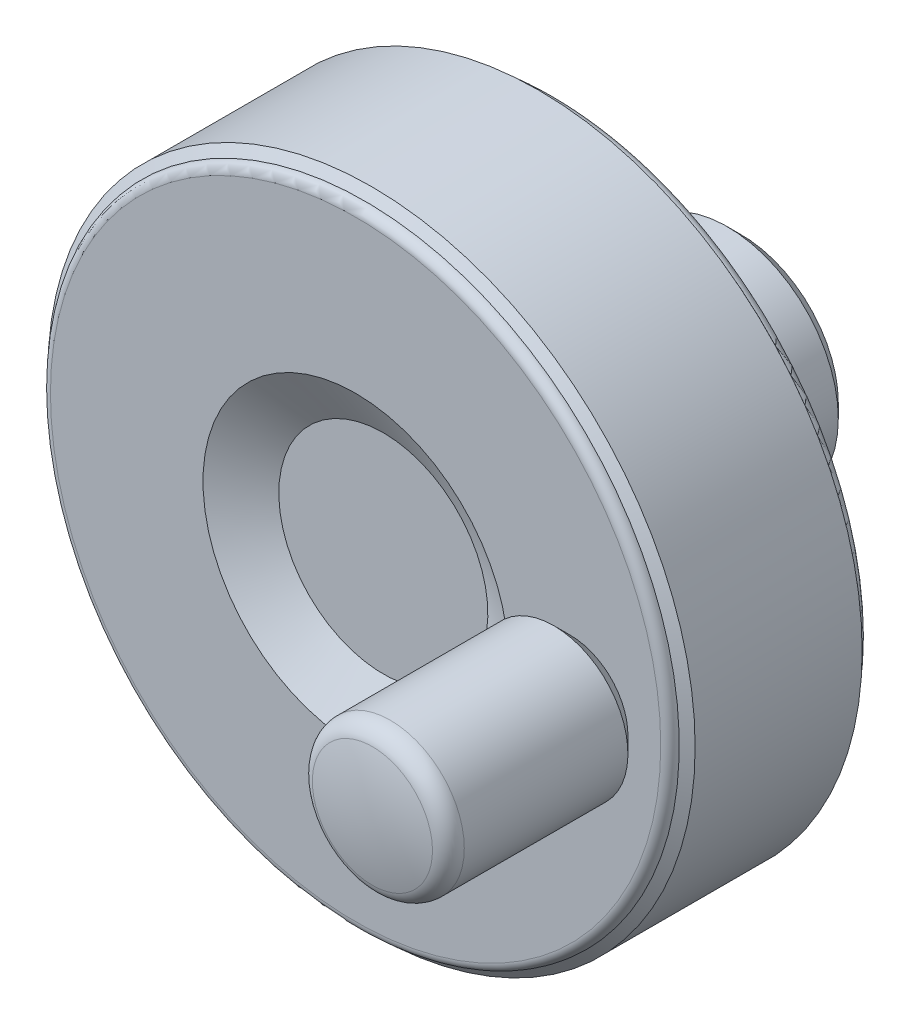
ISO-10303-21;
HEADER;
FILE_DESCRIPTION(('STEP AP214'),'2;1');
FILE_NAME('part.step','',(''),(''),'','','');
FILE_SCHEMA(('AUTOMOTIVE_DESIGN { 1 0 10303 214 1 1 1 1 }'));
ENDSEC;
DATA;
#1=APPLICATION_CONTEXT('core data for automotive mechanical design processes');
#2=APPLICATION_PROTOCOL_DEFINITION('international standard','automotive_design',2000,#1);
#3=PRODUCT_CONTEXT('',#1,'mechanical');
#4=PRODUCT('Part','Part','',(#3));
#5=PRODUCT_RELATED_PRODUCT_CATEGORY('part','',(#4));
#6=PRODUCT_DEFINITION_FORMATION('','',#4);
#7=PRODUCT_DEFINITION_CONTEXT('part definition',#1,'design');
#8=PRODUCT_DEFINITION('design','',#6,#7);
#9=PRODUCT_DEFINITION_SHAPE('','',#8);
#10=(LENGTH_UNIT() NAMED_UNIT(*) SI_UNIT(.MILLI.,.METRE.));
#11=(NAMED_UNIT(*) PLANE_ANGLE_UNIT() SI_UNIT($,.RADIAN.));
#12=(NAMED_UNIT(*) SI_UNIT($,.STERADIAN.) SOLID_ANGLE_UNIT());
#13=UNCERTAINTY_MEASURE_WITH_UNIT(LENGTH_MEASURE(1.E-05),#10,'distance_accuracy_value','');
#14=(GEOMETRIC_REPRESENTATION_CONTEXT(3) GLOBAL_UNCERTAINTY_ASSIGNED_CONTEXT((#13)) GLOBAL_UNIT_ASSIGNED_CONTEXT((#10,
#11,#12)) REPRESENTATION_CONTEXT('',''));
#15=CARTESIAN_POINT('',(0.,0.,0.));
#16=DIRECTION('',(0.,0.,1.));
#17=DIRECTION('',(1.,0.,0.));
#18=AXIS2_PLACEMENT_3D('',#15,#16,#17);
#19=CARTESIAN_POINT('',(-9.66666666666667,0.,4.55662432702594));
#20=DIRECTION('',(0.,-0.5,-0.866025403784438));
#21=DIRECTION('',(0.,-0.866025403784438,0.5));
#22=AXIS2_PLACEMENT_3D('',#19,#20,#21);
#23=PLANE('',#22);
#24=DIRECTION('',(1.,0.,0.));
#25=VECTOR('',#24,1.);
#26=CARTESIAN_POINT('',(-9.66666666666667,-1.25,5.27831216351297));
#27=LINE('',#26,#25);
#28=CARTESIAN_POINT('',(-12.,-1.25,5.27831216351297));
#29=VERTEX_POINT('',#28);
#30=CARTESIAN_POINT('',(-9.66666666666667,-1.25,5.27831216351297));
#31=VERTEX_POINT('',#30);
#32=EDGE_CURVE('E84',#29,#31,#27,.T.);
#33=ORIENTED_EDGE('',*,*,#32,.T.);
#34=DIRECTION('',(0.,-0.866025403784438,0.5));
#35=VECTOR('',#34,1.);
#36=CARTESIAN_POINT('',(-9.66666666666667,0.,4.55662432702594));
#37=LINE('',#36,#35);
#38=CARTESIAN_POINT('',(-9.66666666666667,0.,4.55662432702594));
#39=VERTEX_POINT('',#38);
#40=EDGE_CURVE('E72',#39,#31,#37,.T.);
#41=ORIENTED_EDGE('',*,*,#40,.F.);
#42=DIRECTION('',(-1.,0.,0.));
#43=VECTOR('',#42,1.);
#44=CARTESIAN_POINT('',(-9.66666666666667,0.,4.55662432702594));
#45=LINE('',#44,#43);
#46=CARTESIAN_POINT('',(-12.,0.,4.55662432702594));
#47=VERTEX_POINT('',#46);
#48=EDGE_CURVE('E290',#39,#47,#45,.T.);
#49=ORIENTED_EDGE('',*,*,#48,.T.);
#50=DIRECTION('',(0.,-0.866025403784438,0.5));
#51=VECTOR('',#50,1.);
#52=CARTESIAN_POINT('',(-12.,0.,4.55662432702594));
#53=LINE('',#52,#51);
#54=EDGE_CURVE('E67',#29,#47,#53,.F.);
#55=ORIENTED_EDGE('',*,*,#54,.F.);
#56=EDGE_LOOP('',(#33,#41,#49,#55));
#57=FACE_BOUND('',#56,.T.);
#58=ADVANCED_FACE('F14',(#57),#23,.F.);
#59=CARTESIAN_POINT('',(-9.66666666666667,-1.25,5.27831216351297));
#60=DIRECTION('',(0.,-1.,0.));
#61=DIRECTION('',(1.,0.,0.));
#62=AXIS2_PLACEMENT_3D('',#59,#60,#61);
#63=PLANE('',#62);
#64=DIRECTION('',(-1.,0.,0.));
#65=VECTOR('',#64,1.);
#66=CARTESIAN_POINT('',(-9.66666666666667,-1.25,6.72168783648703));
#67=LINE('',#66,#65);
#68=CARTESIAN_POINT('',(-12.,-1.25,6.72168783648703));
#69=VERTEX_POINT('',#68);
#70=CARTESIAN_POINT('',(-9.66666666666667,-1.25,6.72168783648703));
#71=VERTEX_POINT('',#70);
#72=EDGE_CURVE('E86',#69,#71,#67,.F.);
#73=ORIENTED_EDGE('',*,*,#72,.T.);
#74=DIRECTION('',(0.,0.,1.));
#75=VECTOR('',#74,1.);
#76=CARTESIAN_POINT('',(-9.66666666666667,-1.25,5.27831216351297));
#77=LINE('',#76,#75);
#78=EDGE_CURVE('E75',#31,#71,#77,.T.);
#79=ORIENTED_EDGE('',*,*,#78,.F.);
#80=ORIENTED_EDGE('',*,*,#32,.F.);
#81=DIRECTION('',(0.,0.,1.));
#82=VECTOR('',#81,1.);
#83=CARTESIAN_POINT('',(-12.,-1.25,5.27831216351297));
#84=LINE('',#83,#82);
#85=EDGE_CURVE('E88',#69,#29,#84,.F.);
#86=ORIENTED_EDGE('',*,*,#85,.F.);
#87=EDGE_LOOP('',(#73,#79,#80,#86));
#88=FACE_BOUND('',#87,.T.);
#89=ADVANCED_FACE('F83',(#88),#63,.F.);
#90=CARTESIAN_POINT('',(-9.66666666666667,1.25,5.27831216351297));
#91=DIRECTION('',(0.,0.5,-0.866025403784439));
#92=DIRECTION('',(0.,-0.866025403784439,-0.5));
#93=AXIS2_PLACEMENT_3D('',#90,#91,#92);
#94=PLANE('',#93);
#95=ORIENTED_EDGE('',*,*,#48,.F.);
#96=DIRECTION('',(0.,-0.86602540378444,-0.5));
#97=VECTOR('',#96,1.);
#98=CARTESIAN_POINT('',(-9.66666666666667,1.25,5.27831216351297));
#99=LINE('',#98,#97);
#100=CARTESIAN_POINT('',(-9.66666666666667,1.25,5.27831216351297));
#101=VERTEX_POINT('',#100);
#102=EDGE_CURVE('E78',#101,#39,#99,.T.);
#103=ORIENTED_EDGE('',*,*,#102,.F.);
#104=DIRECTION('',(-1.,0.,0.));
#105=VECTOR('',#104,1.);
#106=CARTESIAN_POINT('',(-9.66666666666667,1.25,5.27831216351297));
#107=LINE('',#106,#105);
#108=CARTESIAN_POINT('',(-12.,1.25,5.27831216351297));
#109=VERTEX_POINT('',#108);
#110=EDGE_CURVE('E278',#101,#109,#107,.T.);
#111=ORIENTED_EDGE('',*,*,#110,.T.);
#112=DIRECTION('',(0.,-0.866025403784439,-0.5));
#113=VECTOR('',#112,1.);
#114=CARTESIAN_POINT('',(-12.,1.25,5.27831216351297));
#115=LINE('',#114,#113);
#116=EDGE_CURVE('E288',#47,#109,#115,.F.);
#117=ORIENTED_EDGE('',*,*,#116,.F.);
#118=EDGE_LOOP('',(#95,#103,#111,#117));
#119=FACE_BOUND('',#118,.T.);
#120=ADVANCED_FACE('F305',(#119),#94,.F.);
#121=CARTESIAN_POINT('',(-9.66666666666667,-1.25,6.72168783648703));
#122=DIRECTION('',(0.,-0.5,0.866025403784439));
#123=DIRECTION('',(0.,0.866025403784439,0.5));
#124=AXIS2_PLACEMENT_3D('',#121,#122,#123);
#125=PLANE('',#124);
#126=DIRECTION('',(-1.,0.,0.));
#127=VECTOR('',#126,1.);
#128=CARTESIAN_POINT('',(-9.66666666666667,0.,7.44337567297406));
#129=LINE('',#128,#127);
#130=CARTESIAN_POINT('',(-12.,0.,7.44337567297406));
#131=VERTEX_POINT('',#130);
#132=CARTESIAN_POINT('',(-9.66666666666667,0.,7.44337567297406));
#133=VERTEX_POINT('',#132);
#134=EDGE_CURVE('E274',#131,#133,#129,.F.);
#135=ORIENTED_EDGE('',*,*,#134,.T.);
#136=DIRECTION('',(0.,0.86602540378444,0.5));
#137=VECTOR('',#136,1.);
#138=CARTESIAN_POINT('',(-9.66666666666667,-1.25,6.72168783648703));
#139=LINE('',#138,#137);
#140=EDGE_CURVE('E283',#71,#133,#139,.T.);
#141=ORIENTED_EDGE('',*,*,#140,.F.);
#142=ORIENTED_EDGE('',*,*,#72,.F.);
#143=DIRECTION('',(0.,0.866025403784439,0.5));
#144=VECTOR('',#143,1.);
#145=CARTESIAN_POINT('',(-12.,-1.25,6.72168783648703));
#146=LINE('',#145,#144);
#147=EDGE_CURVE('E34',#131,#69,#146,.F.);
#148=ORIENTED_EDGE('',*,*,#147,.F.);
#149=EDGE_LOOP('',(#135,#141,#142,#148));
#150=FACE_BOUND('',#149,.T.);
#151=ADVANCED_FACE('F295',(#150),#125,.F.);
#152=CARTESIAN_POINT('',(-9.66666666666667,0.,0.));
#153=DIRECTION('',(-1.,0.,0.));
#154=DIRECTION('',(0.,-1.,0.));
#155=AXIS2_PLACEMENT_3D('',#152,#153,#154);
#156=PLANE('',#155);
#157=ORIENTED_EDGE('',*,*,#78,.T.);
#158=ORIENTED_EDGE('',*,*,#140,.T.);
#159=DIRECTION('',(0.,0.866025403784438,-0.5));
#160=VECTOR('',#159,1.);
#161=CARTESIAN_POINT('',(-9.66666666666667,0.,7.44337567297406));
#162=LINE('',#161,#160);
#163=CARTESIAN_POINT('',(-9.66666666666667,1.25,6.72168783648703));
#164=VERTEX_POINT('',#163);
#165=EDGE_CURVE('E271',#133,#164,#162,.T.);
#166=ORIENTED_EDGE('',*,*,#165,.T.);
#167=DIRECTION('',(0.,0.,1.));
#168=VECTOR('',#167,1.);
#169=CARTESIAN_POINT('',(-9.66666666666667,1.25,6.72168783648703));
#170=LINE('',#169,#168);
#171=EDGE_CURVE('E281',#164,#101,#170,.F.);
#172=ORIENTED_EDGE('',*,*,#171,.T.);
#173=ORIENTED_EDGE('',*,*,#102,.T.);
#174=ORIENTED_EDGE('',*,*,#40,.T.);
#175=EDGE_LOOP('',(#157,#158,#166,#172,#173,#174));
#176=FACE_BOUND('',#175,.T.);
#177=ADVANCED_FACE('F74',(#176),#156,.T.);
#178=CARTESIAN_POINT('',(-9.66666666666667,1.25,6.72168783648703));
#179=DIRECTION('',(0.,1.,0.));
#180=DIRECTION('',(-1.,0.,0.));
#181=AXIS2_PLACEMENT_3D('',#178,#179,#180);
#182=PLANE('',#181);
#183=ORIENTED_EDGE('',*,*,#110,.F.);
#184=ORIENTED_EDGE('',*,*,#171,.F.);
#185=DIRECTION('',(-1.,0.,0.));
#186=VECTOR('',#185,1.);
#187=CARTESIAN_POINT('',(-9.66666666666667,1.25,6.72168783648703));
#188=LINE('',#187,#186);
#189=CARTESIAN_POINT('',(-12.,1.25,6.72168783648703));
#190=VERTEX_POINT('',#189);
#191=EDGE_CURVE('E268',#164,#190,#188,.T.);
#192=ORIENTED_EDGE('',*,*,#191,.T.);
#193=DIRECTION('',(0.,0.,1.));
#194=VECTOR('',#193,1.);
#195=CARTESIAN_POINT('',(-12.,1.25,6.72168783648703));
#196=LINE('',#195,#194);
#197=EDGE_CURVE('E276',#109,#190,#196,.T.);
#198=ORIENTED_EDGE('',*,*,#197,.F.);
#199=EDGE_LOOP('',(#183,#184,#192,#198));
#200=FACE_BOUND('',#199,.T.);
#201=ADVANCED_FACE('F303',(#200),#182,.F.);
#202=CARTESIAN_POINT('',(-9.66666666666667,0.,7.44337567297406));
#203=DIRECTION('',(0.,0.5,0.866025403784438));
#204=DIRECTION('',(0.,0.866025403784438,-0.5));
#205=AXIS2_PLACEMENT_3D('',#202,#203,#204);
#206=PLANE('',#205);
#207=ORIENTED_EDGE('',*,*,#191,.F.);
#208=ORIENTED_EDGE('',*,*,#165,.F.);
#209=ORIENTED_EDGE('',*,*,#134,.F.);
#210=DIRECTION('',(0.,0.866025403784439,-0.5));
#211=VECTOR('',#210,1.);
#212=CARTESIAN_POINT('',(-12.,0.,7.44337567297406));
#213=LINE('',#212,#211);
#214=EDGE_CURVE('E264',#131,#190,#213,.T.);
#215=ORIENTED_EDGE('',*,*,#214,.T.);
#216=EDGE_LOOP('',(#207,#208,#209,#215));
#217=FACE_BOUND('',#216,.T.);
#218=ADVANCED_FACE('F299',(#217),#206,.F.);
#219=CARTESIAN_POINT('',(0.,0.,23.));
#220=DIRECTION('',(0.,0.,1.));
#221=DIRECTION('',(1.,0.,0.));
#222=AXIS2_PLACEMENT_3D('',#219,#220,#221);
#223=CYLINDRICAL_SURFACE('',#222,5.);
#224=CARTESIAN_POINT('',(0.,0.,0.));
#225=DIRECTION('',(0.,0.,1.));
#226=DIRECTION('',(1.,0.,0.));
#227=AXIS2_PLACEMENT_3D('',#224,#225,#226);
#228=CIRCLE('',#227,5.);
#229=CARTESIAN_POINT('',(5.,0.,0.));
#230=VERTEX_POINT('',#229);
#231=EDGE_CURVE('E267',#230,#230,#228,.F.);
#232=ORIENTED_EDGE('',*,*,#231,.T.);
#233=EDGE_LOOP('',(#232));
#234=FACE_BOUND('',#233,.T.);
#235=CARTESIAN_POINT('',(0.,0.,25.));
#236=DIRECTION('',(0.,0.,-1.));
#237=DIRECTION('',(0.,1.,0.));
#238=AXIS2_PLACEMENT_3D('',#235,#236,#237);
#239=CIRCLE('',#238,5.);
#240=CARTESIAN_POINT('',(0.,5.00000000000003,25.));
#241=VERTEX_POINT('',#240);
#242=EDGE_CURVE('E665',#241,#241,#239,.T.);
#243=ORIENTED_EDGE('',*,*,#242,.F.);
#244=EDGE_LOOP('',(#243));
#245=FACE_BOUND('',#244,.T.);
#246=ADVANCED_FACE('F440',(#234,#245),#223,.F.);
#247=CARTESIAN_POINT('',(-12.,0.,8.0095));
#248=DIRECTION('',(1.,0.,0.));
#249=DIRECTION('',(0.,1.,0.));
#250=AXIS2_PLACEMENT_3D('',#247,#248,#249);
#251=PLANE('',#250);
#252=CARTESIAN_POINT('',(-12.0000000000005,0.,6.));
#253=DIRECTION('',(1.,0.,0.));
#254=DIRECTION('',(0.,1.,0.));
#255=AXIS2_PLACEMENT_3D('',#252,#253,#254);
#256=CIRCLE('',#255,2.00949999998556);
#257=CARTESIAN_POINT('',(-12.0000000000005,2.00949999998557,6.));
#258=VERTEX_POINT('',#257);
#259=EDGE_CURVE('E633',#258,#258,#256,.T.);
#260=ORIENTED_EDGE('',*,*,#259,.F.);
#261=EDGE_LOOP('',(#260));
#262=FACE_BOUND('',#261,.T.);
#263=ORIENTED_EDGE('',*,*,#147,.T.);
#264=ORIENTED_EDGE('',*,*,#85,.T.);
#265=ORIENTED_EDGE('',*,*,#54,.T.);
#266=ORIENTED_EDGE('',*,*,#116,.T.);
#267=ORIENTED_EDGE('',*,*,#197,.T.);
#268=ORIENTED_EDGE('',*,*,#214,.F.);
#269=EDGE_LOOP('',(#263,#264,#265,#266,#267,#268));
#270=FACE_BOUND('',#269,.T.);
#271=ADVANCED_FACE('F292',(#262,#270),#251,.F.);
#272=CARTESIAN_POINT('',(-8.,0.,0.));
#273=DIRECTION('',(0.,0.,1.));
#274=DIRECTION('',(1.,0.,0.));
#275=AXIS2_PLACEMENT_3D('',#272,#273,#274);
#276=PLANE('',#275);
#277=CARTESIAN_POINT('',(0.,0.,0.));
#278=DIRECTION('',(0.,0.,1.));
#279=DIRECTION('',(1.,0.,0.));
#280=AXIS2_PLACEMENT_3D('',#277,#278,#279);
#281=CIRCLE('',#280,8.);
#282=CARTESIAN_POINT('',(8.,0.,0.));
#283=VERTEX_POINT('',#282);
#284=EDGE_CURVE('E261',#283,#283,#281,.T.);
#285=ORIENTED_EDGE('',*,*,#284,.F.);
#286=EDGE_LOOP('',(#285));
#287=FACE_BOUND('',#286,.T.);
#288=ORIENTED_EDGE('',*,*,#231,.F.);
#289=EDGE_LOOP('',(#288));
#290=FACE_BOUND('',#289,.T.);
#291=ADVANCED_FACE('F458',(#287,#290),#276,.F.);
#292=CARTESIAN_POINT('',(-11.509500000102,0.,6.));
#293=DIRECTION('',(1.,0.,0.));
#294=DIRECTION('',(0.,1.,0.));
#295=AXIS2_PLACEMENT_3D('',#292,#293,#294);
#296=CONICAL_SURFACE('',#295,2.49999999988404,0.785398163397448);
#297=CARTESIAN_POINT('',(-11.5095,0.,6.));
#298=DIRECTION('',(1.,0.,0.));
#299=DIRECTION('',(0.,1.,0.));
#300=AXIS2_PLACEMENT_3D('',#297,#298,#299);
#301=CIRCLE('',#300,2.5);
#302=CARTESIAN_POINT('',(-11.5095,2.50000000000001,6.));
#303=VERTEX_POINT('',#302);
#304=EDGE_CURVE('E258',#303,#303,#301,.T.);
#305=ORIENTED_EDGE('',*,*,#304,.F.);
#306=EDGE_LOOP('',(#305));
#307=FACE_BOUND('',#306,.T.);
#308=ORIENTED_EDGE('',*,*,#259,.T.);
#309=EDGE_LOOP('',(#308));
#310=FACE_BOUND('',#309,.T.);
#311=ADVANCED_FACE('F467',(#307,#310),#296,.T.);
#312=CARTESIAN_POINT('',(0.,0.,23.));
#313=DIRECTION('',(0.,0.,1.));
#314=DIRECTION('',(1.,0.,0.));
#315=AXIS2_PLACEMENT_3D('',#312,#313,#314);
#316=CYLINDRICAL_SURFACE('',#315,8.);
#317=CARTESIAN_POINT('',(0.,0.,0.3));
#318=DIRECTION('',(0.,0.,1.));
#319=DIRECTION('',(1.,0.,0.));
#320=AXIS2_PLACEMENT_3D('',#317,#318,#319);
#321=CIRCLE('',#320,8.);
#322=CARTESIAN_POINT('',(8.,0.,0.3));
#323=VERTEX_POINT('',#322);
#324=EDGE_CURVE('E255',#323,#323,#321,.F.);
#325=ORIENTED_EDGE('',*,*,#324,.T.);
#326=EDGE_LOOP('',(#325));
#327=FACE_BOUND('',#326,.T.);
#328=ORIENTED_EDGE('',*,*,#284,.T.);
#329=EDGE_LOOP('',(#328));
#330=FACE_BOUND('',#329,.T.);
#331=ADVANCED_FACE('F476',(#327,#330),#316,.T.);
#332=CARTESIAN_POINT('',(-12.,0.,6.));
#333=DIRECTION('',(1.,0.,0.));
#334=DIRECTION('',(0.,1.,0.));
#335=AXIS2_PLACEMENT_3D('',#332,#333,#334);
#336=CYLINDRICAL_SURFACE('',#335,2.5);
#337=CARTESIAN_POINT('',(-8.0000000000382,0.,6.));
#338=DIRECTION('',(-1.,0.,0.));
#339=DIRECTION('',(0.,-1.,0.));
#340=AXIS2_PLACEMENT_3D('',#337,#338,#339);
#341=CIRCLE('',#340,2.49999999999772);
#342=CARTESIAN_POINT('',(-8.0000000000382,-2.49999999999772,6.));
#343=VERTEX_POINT('',#342);
#344=EDGE_CURVE('E252',#343,#343,#341,.T.);
#345=ORIENTED_EDGE('',*,*,#344,.T.);
#346=EDGE_LOOP('',(#345));
#347=FACE_BOUND('',#346,.T.);
#348=ORIENTED_EDGE('',*,*,#304,.T.);
#349=EDGE_LOOP('',(#348));
#350=FACE_BOUND('',#349,.T.);
#351=ADVANCED_FACE('F485',(#347,#350),#336,.T.);
#352=CARTESIAN_POINT('',(-10.5,0.,0.3));
#353=DIRECTION('',(0.,0.,1.));
#354=DIRECTION('',(1.,0.,0.));
#355=AXIS2_PLACEMENT_3D('',#352,#353,#354);
#356=PLANE('',#355);
#357=CARTESIAN_POINT('',(0.,0.,0.3));
#358=DIRECTION('',(0.,0.,1.));
#359=DIRECTION('',(1.,0.,0.));
#360=AXIS2_PLACEMENT_3D('',#357,#358,#359);
#361=CIRCLE('',#360,10.5);
#362=CARTESIAN_POINT('',(10.5,0.,0.3));
#363=VERTEX_POINT('',#362);
#364=EDGE_CURVE('E246',#363,#363,#361,.T.);
#365=ORIENTED_EDGE('',*,*,#364,.F.);
#366=EDGE_LOOP('',(#365));
#367=FACE_BOUND('',#366,.T.);
#368=ORIENTED_EDGE('',*,*,#324,.F.);
#369=EDGE_LOOP('',(#368));
#370=FACE_BOUND('',#369,.T.);
#371=ADVANCED_FACE('F494',(#367,#370),#356,.F.);
#372=CARTESIAN_POINT('',(-8.27777777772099,0.,6.));
#373=DIRECTION('',(-1.,0.,0.));
#374=DIRECTION('',(0.,-1.,0.));
#375=AXIS2_PLACEMENT_3D('',#372,#373,#374);
#376=CONICAL_SURFACE('',#375,2.77777777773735,0.785398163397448);
#377=ORIENTED_EDGE('',*,*,#344,.F.);
#378=EDGE_LOOP('',(#377));
#379=FACE_BOUND('',#378,.T.);
#380=CARTESIAN_POINT('',(-8.27777777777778,0.,6.));
#381=DIRECTION('',(1.,0.,0.));
#382=DIRECTION('',(0.,1.,0.));
#383=AXIS2_PLACEMENT_3D('',#380,#381,#382);
#384=CIRCLE('',#383,2.77777777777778);
#385=CARTESIAN_POINT('',(-8.27777777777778,2.77777777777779,6.));
#386=VERTEX_POINT('',#385);
#387=EDGE_CURVE('E241',#386,#386,#384,.F.);
#388=ORIENTED_EDGE('',*,*,#387,.T.);
#389=EDGE_LOOP('',(#388));
#390=FACE_BOUND('',#389,.T.);
#391=ADVANCED_FACE('F503',(#379,#390),#376,.F.);
#392=CARTESIAN_POINT('',(0.,0.,1.8));
#393=DIRECTION('',(0.,0.,1.));
#394=DIRECTION('',(1.,0.,0.));
#395=AXIS2_PLACEMENT_3D('',#392,#393,#394);
#396=CONICAL_SURFACE('',#395,12.,0.785398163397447);
#397=CARTESIAN_POINT('',(0.,0.,1.8));
#398=DIRECTION('',(0.,0.,1.));
#399=DIRECTION('',(1.,0.,0.));
#400=AXIS2_PLACEMENT_3D('',#397,#398,#399);
#401=CIRCLE('',#400,12.);
#402=CARTESIAN_POINT('',(12.,0.,1.8));
#403=VERTEX_POINT('',#402);
#404=EDGE_CURVE('E238',#403,#403,#401,.T.);
#405=ORIENTED_EDGE('',*,*,#404,.F.);
#406=EDGE_LOOP('',(#405));
#407=FACE_BOUND('',#406,.T.);
#408=ORIENTED_EDGE('',*,*,#364,.T.);
#409=EDGE_LOOP('',(#408));
#410=FACE_BOUND('',#409,.T.);
#411=ADVANCED_FACE('F512',(#407,#410),#396,.T.);
#412=CARTESIAN_POINT('',(-12.,0.,6.));
#413=DIRECTION('',(1.,0.,0.));
#414=DIRECTION('',(0.,1.,0.));
#415=AXIS2_PLACEMENT_3D('',#412,#413,#414);
#416=CYLINDRICAL_SURFACE('',#415,2.77777777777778);
#417=ORIENTED_EDGE('',*,*,#387,.F.);
#418=EDGE_LOOP('',(#417));
#419=FACE_BOUND('',#418,.T.);
#420=CARTESIAN_POINT('',(-11.9992115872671,-0.137556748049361,8.7743697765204));
#421=CARTESIAN_POINT('',(-11.9974424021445,-0.291640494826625,8.76672504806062));
#422=CARTESIAN_POINT('',(-11.9926876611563,-0.445111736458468,8.74620928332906));
#423=CARTESIAN_POINT('',(-11.9777200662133,-0.746338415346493,8.68008264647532));
#424=CARTESIAN_POINT('',(-11.967503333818,-0.894089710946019,8.63445394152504));
#425=CARTESIAN_POINT('',(-11.9427488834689,-1.17951558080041,8.51960840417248));
#426=CARTESIAN_POINT('',(-11.9282163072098,-1.31720190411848,8.45041962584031));
#427=CARTESIAN_POINT('',(-11.8963890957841,-1.5790331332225,8.29046849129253));
#428=CARTESIAN_POINT('',(-11.8790944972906,-1.70317821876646,8.19970642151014));
#429=CARTESIAN_POINT('',(-11.8432878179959,-1.9366819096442,7.99739045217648));
#430=CARTESIAN_POINT('',(-11.8247602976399,-2.04576099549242,7.88551655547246));
#431=CARTESIAN_POINT('',(-11.7887991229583,-2.24373915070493,7.64497718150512));
#432=CARTESIAN_POINT('',(-11.7713655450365,-2.33263681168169,7.51631053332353));
#433=CARTESIAN_POINT('',(-11.7394363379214,-2.48837922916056,7.2444870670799));
#434=CARTESIAN_POINT('',(-11.7249658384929,-2.55503814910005,7.10122059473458));
#435=CARTESIAN_POINT('',(-11.7008722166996,-2.66320978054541,6.8051073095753));
#436=CARTESIAN_POINT('',(-11.6912483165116,-2.70472652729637,6.6522620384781));
#437=CARTESIAN_POINT('',(-11.6781695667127,-2.76064699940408,6.34468341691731));
#438=CARTESIAN_POINT('',(-11.6745919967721,-2.77559041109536,6.19005342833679));
#439=CARTESIAN_POINT('',(-11.6736579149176,-2.77951769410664,5.88045523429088));
#440=CARTESIAN_POINT('',(-11.6763007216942,-2.76850440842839,5.72548706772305));
#441=CARTESIAN_POINT('',(-11.6873861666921,-2.72131669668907,5.42241629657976));
#442=CARTESIAN_POINT('',(-11.695727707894,-2.6855807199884,5.27424130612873));
#443=CARTESIAN_POINT('',(-11.7171426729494,-2.59054480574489,4.98601820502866));
#444=CARTESIAN_POINT('',(-11.7302165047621,-2.53124283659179,4.84597079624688));
#445=CARTESIAN_POINT('',(-11.7598376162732,-2.38987062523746,4.57588181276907));
#446=CARTESIAN_POINT('',(-11.7764289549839,-2.30750686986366,4.445998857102));
#447=CARTESIAN_POINT('',(-11.811148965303,-2.12263622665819,4.20168408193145));
#448=CARTESIAN_POINT('',(-11.8292778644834,-2.02012635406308,4.08725455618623));
#449=CARTESIAN_POINT('',(-11.8655405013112,-1.79505229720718,3.87435198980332));
#450=CARTESIAN_POINT('',(-11.8836646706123,-1.67207944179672,3.7763087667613));
#451=CARTESIAN_POINT('',(-11.9174659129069,-1.4111304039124,3.60221802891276));
#452=CARTESIAN_POINT('',(-11.9331430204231,-1.27315443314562,3.52617020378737));
#453=CARTESIAN_POINT('',(-11.960261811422,-0.986315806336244,3.3984980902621));
#454=CARTESIAN_POINT('',(-11.9717133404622,-0.83747943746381,3.34681694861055));
#455=CARTESIAN_POINT('',(-11.9891298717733,-0.532919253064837,3.26929923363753));
#456=CARTESIAN_POINT('',(-11.9950957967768,-0.37719660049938,3.24345831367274));
#457=CARTESIAN_POINT('',(-12.0007906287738,-0.0671541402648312,3.21878374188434));
#458=CARTESIAN_POINT('',(-12.000660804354,0.0871146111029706,3.21933837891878));
#459=CARTESIAN_POINT('',(-11.9945301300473,0.393314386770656,3.24591813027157));
#460=CARTESIAN_POINT('',(-11.9885295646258,0.545245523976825,3.27194201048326));
#461=CARTESIAN_POINT('',(-11.9713899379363,0.841209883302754,3.34828657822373));
#462=CARTESIAN_POINT('',(-11.9602936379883,0.985297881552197,3.39840523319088));
#463=CARTESIAN_POINT('',(-11.9341594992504,1.26305913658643,3.52133018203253));
#464=CARTESIAN_POINT('',(-11.9191212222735,1.39673123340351,3.59413899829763));
#465=CARTESIAN_POINT('',(-11.886372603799,1.65260806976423,3.76196872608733));
#466=CARTESIAN_POINT('',(-11.868617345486,1.77455000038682,3.85738146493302));
#467=CARTESIAN_POINT('',(-11.8325637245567,2.00089909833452,4.0670594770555));
#468=CARTESIAN_POINT('',(-11.8142652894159,2.10530391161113,4.18132727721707));
#469=CARTESIAN_POINT('',(-11.7787974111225,2.29553650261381,4.42797826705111));
#470=CARTESIAN_POINT('',(-11.7616546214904,2.38099103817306,4.5606536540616));
#471=CARTESIAN_POINT('',(-11.7308609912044,2.5283582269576,4.83886805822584));
#472=CARTESIAN_POINT('',(-11.7172098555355,2.59027286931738,4.98440598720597));
#473=CARTESIAN_POINT('',(-11.6951571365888,2.68808593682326,5.28264025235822));
#474=CARTESIAN_POINT('',(-11.6867011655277,2.72425455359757,5.43524378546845));
#475=CARTESIAN_POINT('',(-11.6758441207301,2.77042266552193,5.74456124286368));
#476=CARTESIAN_POINT('',(-11.6734420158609,2.78042661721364,5.90127446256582));
#477=CARTESIAN_POINT('',(-11.6749680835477,2.77400821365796,6.21037168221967));
#478=CARTESIAN_POINT('',(-11.6787466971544,2.75821021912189,6.36276981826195));
#479=CARTESIAN_POINT('',(-11.6919042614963,2.70188811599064,6.66266847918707));
#480=CARTESIAN_POINT('',(-11.7012833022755,2.66136360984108,6.81016892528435));
#481=CARTESIAN_POINT('',(-11.7245679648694,2.55682500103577,7.09632135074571));
#482=CARTESIAN_POINT('',(-11.738476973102,2.49279332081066,7.23496661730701));
#483=CARTESIAN_POINT('',(-11.7692685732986,2.34310363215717,7.49968111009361));
#484=CARTESIAN_POINT('',(-11.7861515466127,2.25744284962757,7.62574872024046));
#485=CARTESIAN_POINT('',(-11.821492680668,2.06449402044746,7.86496359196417));
#486=CARTESIAN_POINT('',(-11.8399789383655,1.9567358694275,7.97772772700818));
#487=CARTESIAN_POINT('',(-11.8761274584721,1.72379362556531,8.18375039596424));
#488=CARTESIAN_POINT('',(-11.8937895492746,1.59860592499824,8.27700488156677));
#489=CARTESIAN_POINT('',(-11.9265239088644,1.33271943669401,8.44226751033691));
#490=CARTESIAN_POINT('',(-11.9415666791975,1.19187002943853,8.51403947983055));
#491=CARTESIAN_POINT('',(-11.967115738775,0.899757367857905,8.63273547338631));
#492=CARTESIAN_POINT('',(-11.9776257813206,0.748502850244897,8.67968006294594));
#493=CARTESIAN_POINT('',(-11.9912194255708,0.474450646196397,8.73971169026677));
#494=CARTESIAN_POINT('',(-11.9954361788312,0.352824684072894,8.75801308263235));
#495=CARTESIAN_POINT('',(-12.0001363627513,0.108150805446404,8.77838458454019));
#496=CARTESIAN_POINT('',(-12.0006199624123,-0.0148970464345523,8.78045542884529));
#497=CARTESIAN_POINT('',(-11.9992115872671,-0.137556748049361,8.7743697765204));
#498=B_SPLINE_CURVE_WITH_KNOTS('',3,(#420,#421,#422,#423,#424,#425,#426,#427,#428,#429,#430,
#431,#432,#433,#434,#435,#436,#437,#438,#439,#440,#441,#442,#443,#444,#445,#446,#447,#448,#449,
#450,#451,#452,#453,#454,#455,#456,#457,#458,#459,#460,#461,#462,#463,#464,#465,#466,#467,#468,
#469,#470,#471,#472,#473,#474,#475,#476,#477,#478,#479,#480,#481,#482,#483,#484,#485,#486,#487,
#488,#489,#490,#491,#492,#493,#494,#495,#496,#497),.UNSPECIFIED.,.T.,.F.,(4,2,2,2,2,2,2,2,2,2,2,
2,2,2,2,2,2,2,2,2,2,2,2,2,2,2,2,2,2,2,2,2,2,2,2,2,2,2,4),(0.,0.462398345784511,
0.925125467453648,1.38730351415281,1.84947542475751,2.31931583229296,2.7891890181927,
3.26289568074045,3.73652629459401,4.20042293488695,4.66426876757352,5.12009251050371,
5.57595555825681,6.03790708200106,6.49992709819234,6.97262330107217,7.44531283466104,
7.91689394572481,8.38839571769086,8.84897598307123,9.30953393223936,9.76629576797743,
10.2231083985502,10.6885084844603,11.1539709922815,11.6279165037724,12.1018219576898,
12.5706776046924,13.0394533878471,13.4970527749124,13.9546595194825,14.4126091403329,
14.8706175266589,15.3396283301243,15.8087363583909,16.2828267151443,16.756523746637,
17.1246366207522,17.4927328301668),.UNSPECIFIED.);
#499=CARTESIAN_POINT('',(-11.9992115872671,-0.137556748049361,8.7743697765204));
#500=VERTEX_POINT('',#499);
#501=EDGE_CURVE('E235',#500,#500,#498,.T.);
#502=ORIENTED_EDGE('',*,*,#501,.F.);
#503=EDGE_LOOP('',(#502));
#504=FACE_BOUND('',#503,.T.);
#505=ADVANCED_FACE('F521',(#419,#504),#416,.F.);
#506=CARTESIAN_POINT('',(0.,0.,23.));
#507=DIRECTION('',(0.,0.,1.));
#508=DIRECTION('',(1.,0.,0.));
#509=AXIS2_PLACEMENT_3D('',#506,#507,#508);
#510=CYLINDRICAL_SURFACE('',#509,12.);
#511=CARTESIAN_POINT('',(0.,0.,38.));
#512=DIRECTION('',(0.,0.,1.));
#513=DIRECTION('',(1.,0.,0.));
#514=AXIS2_PLACEMENT_3D('',#511,#512,#513);
#515=CIRCLE('',#514,12.);
#516=CARTESIAN_POINT('',(12.,0.,38.));
#517=VERTEX_POINT('',#516);
#518=EDGE_CURVE('E226',#517,#517,#515,.T.);
#519=ORIENTED_EDGE('',*,*,#518,.F.);
#520=EDGE_LOOP('',(#519));
#521=FACE_BOUND('',#520,.T.);
#522=ORIENTED_EDGE('',*,*,#501,.T.);
#523=EDGE_LOOP('',(#522));
#524=FACE_BOUND('',#523,.T.);
#525=ORIENTED_EDGE('',*,*,#404,.T.);
#526=EDGE_LOOP('',(#525));
#527=FACE_BOUND('',#526,.T.);
#528=ADVANCED_FACE('F530',(#521,#524,#527),#510,.T.);
#529=CARTESIAN_POINT('',(0.,0.,23.));
#530=DIRECTION('',(0.,0.,1.));
#531=DIRECTION('',(1.,0.,0.));
#532=AXIS2_PLACEMENT_3D('',#529,#530,#531);
#533=CYLINDRICAL_SURFACE('',#532,35.);
#534=CARTESIAN_POINT('',(0.,0.,40.28));
#535=DIRECTION('',(0.,0.,1.));
#536=DIRECTION('',(1.,0.,0.));
#537=AXIS2_PLACEMENT_3D('',#534,#535,#536);
#538=CIRCLE('',#537,35.);
#539=CARTESIAN_POINT('',(35.,0.,40.28));
#540=VERTEX_POINT('',#539);
#541=EDGE_CURVE('E90',#540,#540,#538,.F.);
#542=ORIENTED_EDGE('',*,*,#541,.T.);
#543=EDGE_LOOP('',(#542));
#544=FACE_BOUND('',#543,.T.);
#545=CARTESIAN_POINT('',(0.,0.,22.22));
#546=DIRECTION('',(0.,0.,1.));
#547=DIRECTION('',(1.,0.,0.));
#548=AXIS2_PLACEMENT_3D('',#545,#546,#547);
#549=CIRCLE('',#548,35.);
#550=CARTESIAN_POINT('',(35.,0.,22.22));
#551=VERTEX_POINT('',#550);
#552=EDGE_CURVE('E234',#551,#551,#549,.F.);
#553=ORIENTED_EDGE('',*,*,#552,.F.);
#554=EDGE_LOOP('',(#553));
#555=FACE_BOUND('',#554,.T.);
#556=ADVANCED_FACE('F539',(#544,#555),#533,.T.);
#557=CARTESIAN_POINT('',(0.,0.,39.));
#558=DIRECTION('',(0.,0.,1.));
#559=DIRECTION('',(0.,1.,0.));
#560=AXIS2_PLACEMENT_3D('',#557,#558,#559);
#561=CONICAL_SURFACE('',#560,13.,0.785398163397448);
#562=CARTESIAN_POINT('',(0.,0.,39.));
#563=DIRECTION('',(0.,0.,1.));
#564=DIRECTION('',(0.,1.,0.));
#565=AXIS2_PLACEMENT_3D('',#562,#563,#564);
#566=CIRCLE('',#565,13.);
#567=CARTESIAN_POINT('',(0.,13.,39.));
#568=VERTEX_POINT('',#567);
#569=EDGE_CURVE('E251',#568,#568,#566,.F.);
#570=ORIENTED_EDGE('',*,*,#569,.T.);
#571=EDGE_LOOP('',(#570));
#572=FACE_BOUND('',#571,.T.);
#573=ORIENTED_EDGE('',*,*,#518,.T.);
#574=EDGE_LOOP('',(#573));
#575=FACE_BOUND('',#574,.T.);
#576=ADVANCED_FACE('F548',(#572,#575),#561,.T.);
#577=CARTESIAN_POINT('',(0.,0.,22.22));
#578=DIRECTION('',(0.,0.,1.));
#579=DIRECTION('',(1.,0.,0.));
#580=AXIS2_PLACEMENT_3D('',#577,#578,#579);
#581=CONICAL_SURFACE('',#580,35.,0.946773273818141);
#582=ORIENTED_EDGE('',*,*,#552,.T.);
#583=EDGE_LOOP('',(#582));
#584=FACE_BOUND('',#583,.T.);
#585=CARTESIAN_POINT('',(0.,0.,21.5));
#586=DIRECTION('',(0.,0.,-1.));
#587=DIRECTION('',(-1.,0.,0.));
#588=AXIS2_PLACEMENT_3D('',#585,#586,#587);
#589=CIRCLE('',#588,34.);
#590=CARTESIAN_POINT('',(-34.,0.,21.5));
#591=VERTEX_POINT('',#590);
#592=EDGE_CURVE('E211',#591,#591,#589,.T.);
#593=ORIENTED_EDGE('',*,*,#592,.F.);
#594=EDGE_LOOP('',(#593));
#595=FACE_BOUND('',#594,.T.);
#596=ADVANCED_FACE('F557',(#584,#595),#581,.T.);
#597=CARTESIAN_POINT('',(-30.,0.,39.));
#598=DIRECTION('',(0.,0.,1.));
#599=DIRECTION('',(1.,0.,0.));
#600=AXIS2_PLACEMENT_3D('',#597,#598,#599);
#601=PLANE('',#600);
#602=CARTESIAN_POINT('',(0.,0.,39.));
#603=DIRECTION('',(0.,0.,-1.));
#604=DIRECTION('',(0.,-1.,0.));
#605=AXIS2_PLACEMENT_3D('',#602,#603,#604);
#606=CIRCLE('',#605,30.);
#607=CARTESIAN_POINT('',(0.,-30.,39.));
#608=VERTEX_POINT('',#607);
#609=EDGE_CURVE('E585',#608,#608,#606,.T.);
#610=ORIENTED_EDGE('',*,*,#609,.T.);
#611=EDGE_LOOP('',(#610));
#612=FACE_BOUND('',#611,.T.);
#613=ORIENTED_EDGE('',*,*,#569,.F.);
#614=EDGE_LOOP('',(#613));
#615=FACE_BOUND('',#614,.T.);
#616=ADVANCED_FACE('F217',(#612,#615),#601,.F.);
#617=CARTESIAN_POINT('',(0.,0.,21.5));
#618=DIRECTION('',(0.,0.,-1.));
#619=DIRECTION('',(-1.,0.,0.));
#620=AXIS2_PLACEMENT_3D('',#617,#618,#619);
#621=TOROIDAL_SURFACE('',#620,33.,1.);
#622=CARTESIAN_POINT('',(0.,0.,20.5));
#623=DIRECTION('',(0.,0.,1.));
#624=DIRECTION('',(-1.,0.,0.));
#625=AXIS2_PLACEMENT_3D('',#622,#623,#624);
#626=CIRCLE('',#625,33.);
#627=CARTESIAN_POINT('',(-33.,0.,20.5));
#628=VERTEX_POINT('',#627);
#629=EDGE_CURVE('E586',#628,#628,#626,.T.);
#630=ORIENTED_EDGE('',*,*,#629,.T.);
#631=EDGE_LOOP('',(#630));
#632=FACE_BOUND('',#631,.T.);
#633=ORIENTED_EDGE('',*,*,#592,.T.);
#634=EDGE_LOOP('',(#633));
#635=FACE_BOUND('',#634,.T.);
#636=ADVANCED_FACE('F213',(#632,#635),#621,.T.);
#637=CARTESIAN_POINT('',(0.,0.,38.));
#638=DIRECTION('',(0.,0.,-1.));
#639=DIRECTION('',(0.,-1.,0.));
#640=AXIS2_PLACEMENT_3D('',#637,#638,#639);
#641=CONICAL_SURFACE('',#640,31.,0.785398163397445);
#642=CARTESIAN_POINT('',(0.,0.,38.));
#643=DIRECTION('',(0.,0.,1.));
#644=DIRECTION('',(1.,0.,0.));
#645=AXIS2_PLACEMENT_3D('',#642,#643,#644);
#646=CIRCLE('',#645,31.);
#647=CARTESIAN_POINT('',(31.,0.,38.));
#648=VERTEX_POINT('',#647);
#649=EDGE_CURVE('E25',#648,#648,#646,.F.);
#650=ORIENTED_EDGE('',*,*,#649,.T.);
#651=EDGE_LOOP('',(#650));
#652=FACE_BOUND('',#651,.T.);
#653=ORIENTED_EDGE('',*,*,#609,.F.);
#654=EDGE_LOOP('',(#653));
#655=FACE_BOUND('',#654,.T.);
#656=ADVANCED_FACE('F187',(#652,#655),#641,.F.);
#657=CARTESIAN_POINT('',(-33.,0.,20.5));
#658=DIRECTION('',(0.,0.,1.));
#659=DIRECTION('',(1.,0.,0.));
#660=AXIS2_PLACEMENT_3D('',#657,#658,#659);
#661=PLANE('',#660);
#662=ORIENTED_EDGE('',*,*,#629,.F.);
#663=EDGE_LOOP('',(#662));
#664=FACE_BOUND('',#663,.T.);
#665=CARTESIAN_POINT('',(0.,0.,20.5));
#666=DIRECTION('',(0.,0.,1.));
#667=DIRECTION('',(1.,0.,0.));
#668=AXIS2_PLACEMENT_3D('',#665,#666,#667);
#669=CIRCLE('',#668,31.);
#670=CARTESIAN_POINT('',(31.,0.,20.5));
#671=VERTEX_POINT('',#670);
#672=EDGE_CURVE('E9',#671,#671,#669,.T.);
#673=ORIENTED_EDGE('',*,*,#672,.T.);
#674=EDGE_LOOP('',(#673));
#675=FACE_BOUND('',#674,.T.);
#676=ADVANCED_FACE('F178',(#664,#675),#661,.F.);
#677=CARTESIAN_POINT('',(0.,0.,23.));
#678=DIRECTION('',(0.,0.,1.));
#679=DIRECTION('',(1.,0.,0.));
#680=AXIS2_PLACEMENT_3D('',#677,#678,#679);
#681=CYLINDRICAL_SURFACE('',#680,31.);
#682=ORIENTED_EDGE('',*,*,#672,.F.);
#683=EDGE_LOOP('',(#682));
#684=FACE_BOUND('',#683,.T.);
#685=ORIENTED_EDGE('',*,*,#649,.F.);
#686=EDGE_LOOP('',(#685));
#687=FACE_BOUND('',#686,.T.);
#688=ADVANCED_FACE('F176',(#684,#687),#681,.F.);
#689=CARTESIAN_POINT('',(24.,0.,38.775));
#690=DIRECTION('',(0.,-1.,0.));
#691=DIRECTION('',(-1.,0.,0.));
#692=AXIS2_PLACEMENT_3D('',#689,#690,#691);
#693=SPHERICAL_SURFACE('',#692,26.225);
#694=CARTESIAN_POINT('',(24.,0.,64.1828919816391));
#695=DIRECTION('',(0.,0.,-1.));
#696=DIRECTION('',(0.,-1.,0.));
#697=AXIS2_PLACEMENT_3D('',#694,#695,#696);
#698=CIRCLE('',#697,6.49535603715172);
#699=CARTESIAN_POINT('',(24.,-6.49535603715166,64.1828919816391));
#700=VERTEX_POINT('',#699);
#701=EDGE_CURVE('E19',#700,#700,#698,.T.);
#702=ORIENTED_EDGE('',*,*,#701,.F.);
#703=EDGE_LOOP('',(#702));
#704=FACE_BOUND('',#703,.T.);
#705=ADVANCED_FACE('F16',(#704),#693,.T.);
#706=CARTESIAN_POINT('',(24.,0.,62.2452071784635));
#707=DIRECTION('',(0.,0.,-1.));
#708=DIRECTION('',(0.,-1.,0.));
#709=AXIS2_PLACEMENT_3D('',#706,#707,#708);
#710=TOROIDAL_SURFACE('',#709,6.00000000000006,2.);
#711=CARTESIAN_POINT('',(24.,0.,62.2452071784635));
#712=DIRECTION('',(0.,0.,1.));
#713=DIRECTION('',(0.,1.,0.));
#714=AXIS2_PLACEMENT_3D('',#711,#712,#713);
#715=CIRCLE('',#714,8.);
#716=CARTESIAN_POINT('',(24.,8.00000000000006,62.2452071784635));
#717=VERTEX_POINT('',#716);
#718=EDGE_CURVE('E133',#717,#717,#715,.F.);
#719=ORIENTED_EDGE('',*,*,#718,.F.);
#720=EDGE_LOOP('',(#719));
#721=FACE_BOUND('',#720,.T.);
#722=ORIENTED_EDGE('',*,*,#701,.T.);
#723=EDGE_LOOP('',(#722));
#724=FACE_BOUND('',#723,.T.);
#725=ADVANCED_FACE('F142',(#721,#724),#710,.T.);
#726=CARTESIAN_POINT('',(24.,0.,42.));
#727=DIRECTION('',(0.,0.,1.));
#728=DIRECTION('',(0.,1.,0.));
#729=AXIS2_PLACEMENT_3D('',#726,#727,#728);
#730=CYLINDRICAL_SURFACE('',#729,8.);
#731=ORIENTED_EDGE('',*,*,#718,.T.);
#732=EDGE_LOOP('',(#731));
#733=FACE_BOUND('',#732,.T.);
#734=CARTESIAN_POINT('',(24.,0.,44.55));
#735=DIRECTION('',(0.,0.,1.));
#736=DIRECTION('',(0.,1.,0.));
#737=AXIS2_PLACEMENT_3D('',#734,#735,#736);
#738=CIRCLE('',#737,8.);
#739=CARTESIAN_POINT('',(24.,8.00000000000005,44.55));
#740=VERTEX_POINT('',#739);
#741=EDGE_CURVE('E124',#740,#740,#738,.F.);
#742=ORIENTED_EDGE('',*,*,#741,.F.);
#743=EDGE_LOOP('',(#742));
#744=FACE_BOUND('',#743,.T.);
#745=ADVANCED_FACE('F145',(#733,#744),#730,.T.);
#746=CARTESIAN_POINT('',(24.,0.,44.55));
#747=DIRECTION('',(0.,0.,1.));
#748=DIRECTION('',(0.,1.,0.));
#749=AXIS2_PLACEMENT_3D('',#746,#747,#748);
#750=CONICAL_SURFACE('',#749,8.,0.785398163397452);
#751=ORIENTED_EDGE('',*,*,#741,.T.);
#752=EDGE_LOOP('',(#751));
#753=FACE_BOUND('',#752,.T.);
#754=CARTESIAN_POINT('',(24.,0.,42.8));
#755=DIRECTION('',(0.,0.,1.));
#756=DIRECTION('',(0.,1.,0.));
#757=AXIS2_PLACEMENT_3D('',#754,#755,#756);
#758=CIRCLE('',#757,6.25);
#759=CARTESIAN_POINT('',(24.,6.25000000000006,42.8));
#760=VERTEX_POINT('',#759);
#761=EDGE_CURVE('E132',#760,#760,#758,.T.);
#762=ORIENTED_EDGE('',*,*,#761,.T.);
#763=EDGE_LOOP('',(#762));
#764=FACE_BOUND('',#763,.T.);
#765=ADVANCED_FACE('F149',(#753,#764),#750,.T.);
#766=CARTESIAN_POINT('',(0.,0.,39.));
#767=DIRECTION('',(0.,0.,-1.));
#768=DIRECTION('',(-1.,0.,0.));
#769=AXIS2_PLACEMENT_3D('',#766,#767,#768);
#770=PLANE('',#769);
#771=CARTESIAN_POINT('',(0.,0.,39.));
#772=DIRECTION('',(0.,0.,1.));
#773=DIRECTION('',(0.,1.,0.));
#774=AXIS2_PLACEMENT_3D('',#771,#772,#773);
#775=CIRCLE('',#774,11.3038475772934);
#776=CARTESIAN_POINT('',(0.,11.3038475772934,39.));
#777=VERTEX_POINT('',#776);
#778=EDGE_CURVE('E646',#777,#777,#775,.T.);
#779=ORIENTED_EDGE('',*,*,#778,.T.);
#780=EDGE_LOOP('',(#779));
#781=FACE_BOUND('',#780,.T.);
#782=ADVANCED_FACE('F153',(#781),#770,.F.);
#783=CARTESIAN_POINT('',(24.,-6.25,42.8));
#784=DIRECTION('',(0.,0.,1.));
#785=DIRECTION('',(0.,1.,0.));
#786=AXIS2_PLACEMENT_3D('',#783,#784,#785);
#787=PLANE('',#786);
#788=ORIENTED_EDGE('',*,*,#761,.F.);
#789=EDGE_LOOP('',(#788));
#790=FACE_BOUND('',#789,.T.);
#791=CARTESIAN_POINT('',(24.,0.,42.8));
#792=DIRECTION('',(0.,0.,1.));
#793=DIRECTION('',(0.,1.,0.));
#794=AXIS2_PLACEMENT_3D('',#791,#792,#793);
#795=CIRCLE('',#794,3.);
#796=CARTESIAN_POINT('',(24.,3.00000000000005,42.8));
#797=VERTEX_POINT('',#796);
#798=EDGE_CURVE('E644',#797,#797,#795,.F.);
#799=ORIENTED_EDGE('',*,*,#798,.F.);
#800=EDGE_LOOP('',(#799));
#801=FACE_BOUND('',#800,.T.);
#802=ADVANCED_FACE('F157',(#790,#801),#787,.F.);
#803=CARTESIAN_POINT('',(0.,0.,42.));
#804=DIRECTION('',(0.,0.,1.));
#805=DIRECTION('',(0.,1.,0.));
#806=AXIS2_PLACEMENT_3D('',#803,#804,#805);
#807=CONICAL_SURFACE('',#806,16.5,1.0471975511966);
#808=ORIENTED_EDGE('',*,*,#778,.F.);
#809=EDGE_LOOP('',(#808));
#810=FACE_BOUND('',#809,.T.);
#811=CARTESIAN_POINT('',(0.,0.,42.));
#812=DIRECTION('',(0.,0.,1.));
#813=DIRECTION('',(0.,1.,0.));
#814=AXIS2_PLACEMENT_3D('',#811,#812,#813);
#815=CIRCLE('',#814,16.5);
#816=CARTESIAN_POINT('',(0.,16.5000000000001,42.));
#817=VERTEX_POINT('',#816);
#818=EDGE_CURVE('E641',#817,#817,#815,.T.);
#819=ORIENTED_EDGE('',*,*,#818,.T.);
#820=EDGE_LOOP('',(#819));
#821=FACE_BOUND('',#820,.T.);
#822=ADVANCED_FACE('F161',(#810,#821),#807,.F.);
#823=CARTESIAN_POINT('',(24.,0.,42.));
#824=DIRECTION('',(0.,0.,1.));
#825=DIRECTION('',(0.,1.,0.));
#826=AXIS2_PLACEMENT_3D('',#823,#824,#825);
#827=CYLINDRICAL_SURFACE('',#826,3.);
#828=ORIENTED_EDGE('',*,*,#798,.T.);
#829=EDGE_LOOP('',(#828));
#830=FACE_BOUND('',#829,.T.);
#831=CARTESIAN_POINT('',(24.,0.,42.));
#832=DIRECTION('',(0.,0.,1.));
#833=DIRECTION('',(0.,1.,0.));
#834=AXIS2_PLACEMENT_3D('',#831,#832,#833);
#835=CIRCLE('',#834,3.);
#836=CARTESIAN_POINT('',(24.,3.00000000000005,42.));
#837=VERTEX_POINT('',#836);
#838=EDGE_CURVE('E638',#837,#837,#835,.T.);
#839=ORIENTED_EDGE('',*,*,#838,.T.);
#840=EDGE_LOOP('',(#839));
#841=FACE_BOUND('',#840,.T.);
#842=ADVANCED_FACE('F164',(#830,#841),#827,.T.);
#843=CARTESIAN_POINT('',(-16.5,0.,42.));
#844=DIRECTION('',(0.,0.,-1.));
#845=DIRECTION('',(-1.,0.,0.));
#846=AXIS2_PLACEMENT_3D('',#843,#844,#845);
#847=PLANE('',#846);
#848=ORIENTED_EDGE('',*,*,#838,.F.);
#849=EDGE_LOOP('',(#848));
#850=FACE_BOUND('',#849,.T.);
#851=ORIENTED_EDGE('',*,*,#818,.F.);
#852=EDGE_LOOP('',(#851));
#853=FACE_BOUND('',#852,.T.);
#854=CARTESIAN_POINT('',(0.,0.,42.));
#855=DIRECTION('',(0.,0.,-1.));
#856=DIRECTION('',(-1.,0.,0.));
#857=AXIS2_PLACEMENT_3D('',#854,#855,#856);
#858=CIRCLE('',#857,33.);
#859=CARTESIAN_POINT('',(-33.,1.89945779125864E-13,42.));
#860=VERTEX_POINT('',#859);
#861=EDGE_CURVE('E99',#860,#860,#858,.T.);
#862=ORIENTED_EDGE('',*,*,#861,.F.);
#863=EDGE_LOOP('',(#862));
#864=FACE_BOUND('',#863,.T.);
#865=ADVANCED_FACE('F113',(#850,#853,#864),#847,.F.);
#866=CARTESIAN_POINT('',(0.,0.,41.));
#867=DIRECTION('',(0.,0.,-1.));
#868=DIRECTION('',(-1.,0.,0.));
#869=AXIS2_PLACEMENT_3D('',#866,#867,#868);
#870=TOROIDAL_SURFACE('',#869,33.,1.);
#871=CARTESIAN_POINT('',(0.,0.,41.));
#872=DIRECTION('',(0.,0.,-1.));
#873=DIRECTION('',(-1.,0.,0.));
#874=AXIS2_PLACEMENT_3D('',#871,#872,#873);
#875=CIRCLE('',#874,34.);
#876=CARTESIAN_POINT('',(-34.,0.,41.));
#877=VERTEX_POINT('',#876);
#878=EDGE_CURVE('E80',#877,#877,#875,.T.);
#879=ORIENTED_EDGE('',*,*,#878,.F.);
#880=EDGE_LOOP('',(#879));
#881=FACE_BOUND('',#880,.T.);
#882=ORIENTED_EDGE('',*,*,#861,.T.);
#883=EDGE_LOOP('',(#882));
#884=FACE_BOUND('',#883,.T.);
#885=ADVANCED_FACE('F107',(#881,#884),#870,.T.);
#886=CARTESIAN_POINT('',(0.,0.,40.28));
#887=DIRECTION('',(0.,0.,-1.));
#888=DIRECTION('',(-1.,0.,0.));
#889=AXIS2_PLACEMENT_3D('',#886,#887,#888);
#890=CONICAL_SURFACE('',#889,35.,0.946773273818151);
#891=ORIENTED_EDGE('',*,*,#541,.F.);
#892=EDGE_LOOP('',(#891));
#893=FACE_BOUND('',#892,.T.);
#894=ORIENTED_EDGE('',*,*,#878,.T.);
#895=EDGE_LOOP('',(#894));
#896=FACE_BOUND('',#895,.T.);
#897=ADVANCED_FACE('F112',(#893,#896),#890,.T.);
#898=CARTESIAN_POINT('',(0.,0.,25.));
#899=DIRECTION('',(0.,0.,-1.));
#900=DIRECTION('',(0.,1.,0.));
#901=AXIS2_PLACEMENT_3D('',#898,#899,#900);
#902=PLANE('',#901);
#903=ORIENTED_EDGE('',*,*,#242,.T.);
#904=EDGE_LOOP('',(#903));
#905=FACE_BOUND('',#904,.T.);
#906=ADVANCED_FACE('F193',(#905),#902,.T.);
#907=CLOSED_SHELL('',(#58,#89,#120,#151,#177,#201,#218,#246,#271,#291,#311,#331,#351,#371,#391,
#411,#505,#528,#556,#576,#596,#616,#636,#656,#676,#688,#705,#725,#745,#765,#782,#802,#822,#842,
#865,#885,#897,#906));
#908=MANIFOLD_SOLID_BREP('B1',#907);
#909=ADVANCED_BREP_SHAPE_REPRESENTATION('',(#18,#908),#14);
#910=SHAPE_DEFINITION_REPRESENTATION(#9,#909);
ENDSEC;
END-ISO-10303-21;
